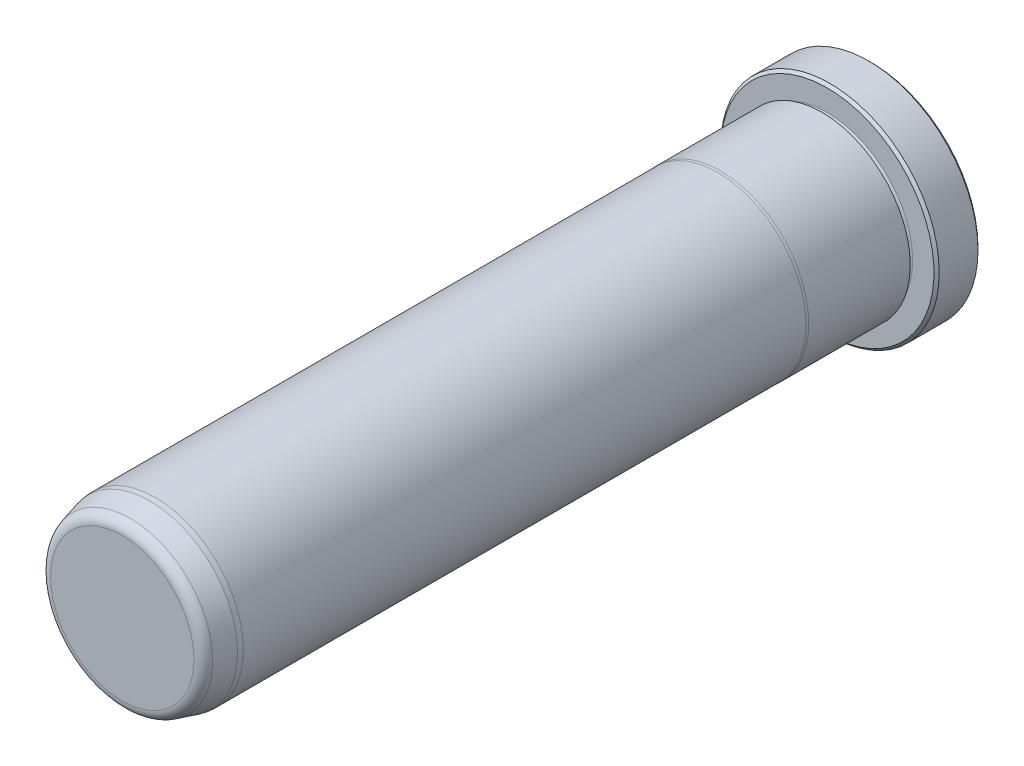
from build123d import *

# Parameters (mm, degrees)
FILLET6_R     = 1.5875
CHAMFER1_SIZE = 0.381


with BuildPart() as part:
    # Sketch1 → Revolve1 (revolve)
    with BuildSketch(Plane(origin=(0, 0, 0), x_dir=(0, 0, -1), z_dir=(1, 0, 0)), mode=Mode.PRIVATE) as revolve1_sk:
        with BuildLine():
            Line((0, 0), (0, 15.748))
            Line((0, 15.748), (-6.35, 15.748))
            Line((-6.35, 15.748), (-6.35, 12.3063))
            ThreePointArc((-6.35, 12.3063), (-6.731, 11.9253), (-7.112, 12.3063))
            Line((-7.112, 12.3063), (-7.112, 12.7127))
            Line((-7.112, 12.7127), (-21.734763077, 12.7127))
            Line((-21.734763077, 12.7127), (-22.098, 12.6873))
            Line((-22.098, 12.6873), (-103.1875, 12.6873))
            Line((-103.1875, 12.6873), (-103.9495, 12.620633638))
            Line((-103.9495, 12.620633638), (-107.95, 11.548702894))
            Line((-107.95, 11.548702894), (-107.95, 0))
            Line((-107.95, 0), (0, 0))
        make_face()
    revolve(revolve1_sk.sketch.rotate(Axis((0, 0, 0), (0, 0, -1)), 90), axis=Axis((0, 0, 0), (0, 0, -1)))

    # Fillet6
    fillet6_edges = [part.edges().sort_by_distance(p)[0] for p in [
        (-11.548702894, 0, 107.95),
    ]]
    fillet(fillet6_edges, radius=FILLET6_R)

    # Chamfer1
    chamfer1_edges = [part.edges().sort_by_distance(p)[0] for p in [
        (-15.748, 0, 6.35),
        (-15.748, 0, 0),
    ]]
    chamfer(chamfer1_edges, length=CHAMFER1_SIZE)


solid = part.part
